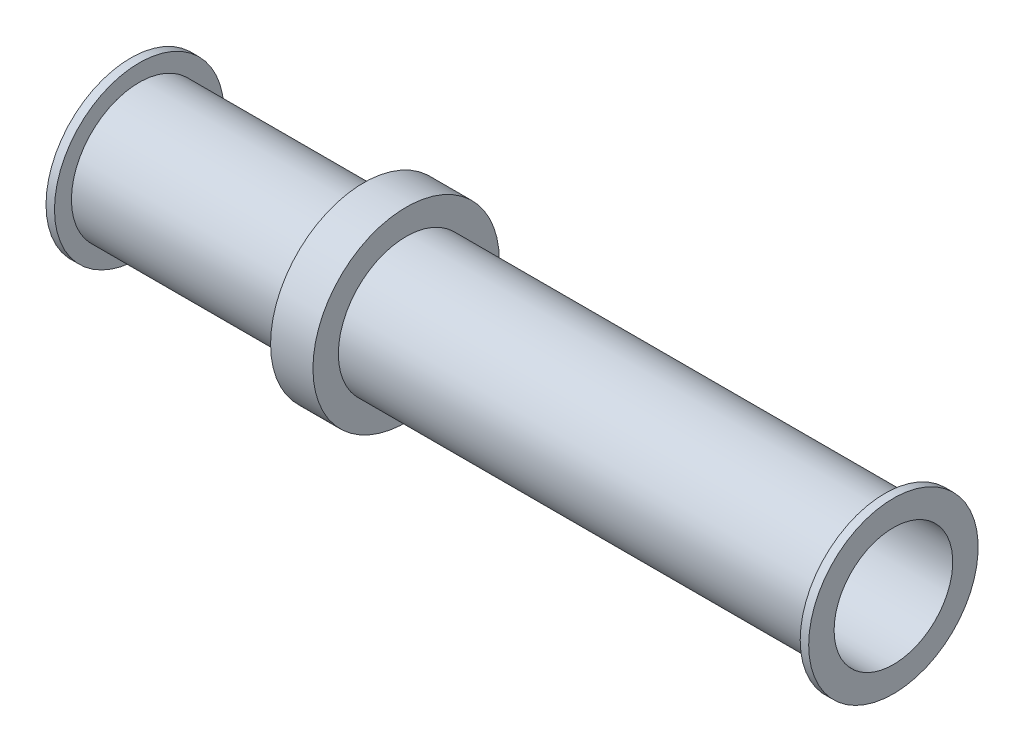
from build123d import *


with BuildPart() as part:
    # Sketch1 → Revolve1 (revolve)
    with BuildSketch(Plane.XY, mode=Mode.PRIVATE) as revolve1_sk:
        Polygon((0, 1.778), (0, 2.54), (0.254, 2.54), (0.254, 2.032), (6.985, 2.032), (6.985, 2.794), (8.255, 2.794), (8.255, 2.032), (22.606, 2.032), (22.606, 2.54), (22.86, 2.54), (22.86, 1.778), align=None)
    revolve(revolve1_sk.sketch.rotate(Axis((0, 0, 0), (1, 0, 0)), 90), axis=Axis((0, 0, 0), (1, 0, 0)))


solid = part.part
